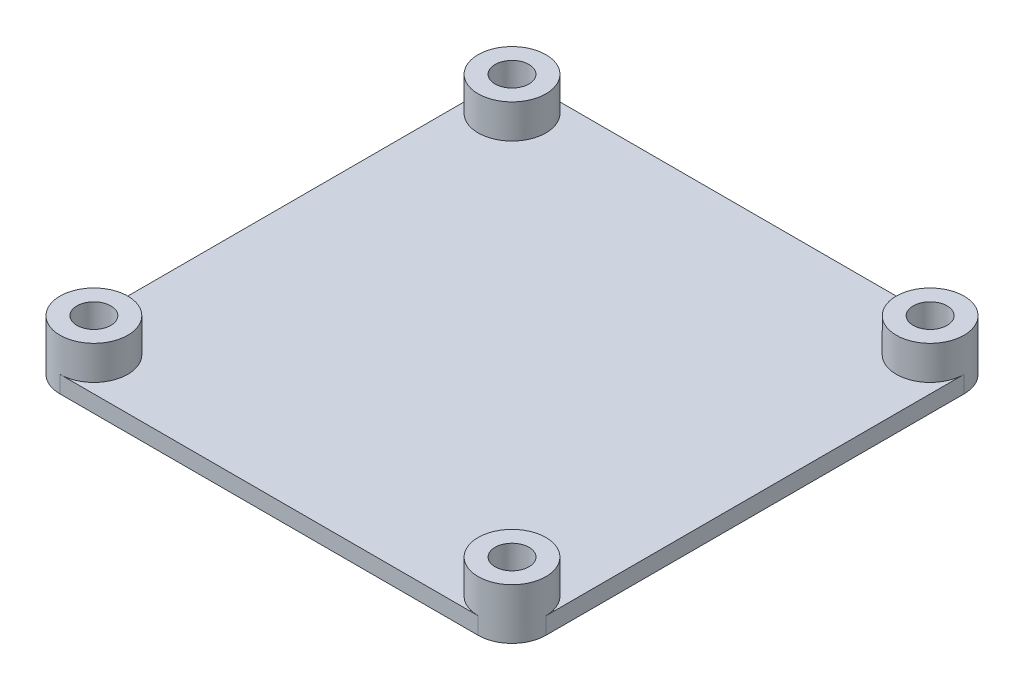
ISO-10303-21;
HEADER;
FILE_DESCRIPTION(('STEP AP214'),'2;1');
FILE_NAME('part.step','',(''),(''),'','','');
FILE_SCHEMA(('AUTOMOTIVE_DESIGN { 1 0 10303 214 1 1 1 1 }'));
ENDSEC;
DATA;
#1=APPLICATION_CONTEXT('core data for automotive mechanical design processes');
#2=APPLICATION_PROTOCOL_DEFINITION('international standard','automotive_design',2000,#1);
#3=PRODUCT_CONTEXT('',#1,'mechanical');
#4=PRODUCT('Part','Part','',(#3));
#5=PRODUCT_RELATED_PRODUCT_CATEGORY('part','',(#4));
#6=PRODUCT_DEFINITION_FORMATION('','',#4);
#7=PRODUCT_DEFINITION_CONTEXT('part definition',#1,'design');
#8=PRODUCT_DEFINITION('design','',#6,#7);
#9=PRODUCT_DEFINITION_SHAPE('','',#8);
#10=(LENGTH_UNIT() NAMED_UNIT(*) SI_UNIT(.MILLI.,.METRE.));
#11=(NAMED_UNIT(*) PLANE_ANGLE_UNIT() SI_UNIT($,.RADIAN.));
#12=(NAMED_UNIT(*) SI_UNIT($,.STERADIAN.) SOLID_ANGLE_UNIT());
#13=UNCERTAINTY_MEASURE_WITH_UNIT(LENGTH_MEASURE(1.E-05),#10,'distance_accuracy_value','');
#14=(GEOMETRIC_REPRESENTATION_CONTEXT(3) GLOBAL_UNCERTAINTY_ASSIGNED_CONTEXT((#13)) GLOBAL_UNIT_ASSIGNED_CONTEXT((#10,
#11,#12)) REPRESENTATION_CONTEXT('',''));
#15=CARTESIAN_POINT('',(0.,0.,0.));
#16=DIRECTION('',(0.,0.,1.));
#17=DIRECTION('',(1.,0.,0.));
#18=AXIS2_PLACEMENT_3D('',#15,#16,#17);
#19=CARTESIAN_POINT('',(-18.5,1.5,-18.5));
#20=DIRECTION('',(0.,1.,0.));
#21=DIRECTION('',(0.,0.,1.));
#22=AXIS2_PLACEMENT_3D('',#19,#20,#21);
#23=PLANE('',#22);
#24=DIRECTION('',(0.,0.,1.));
#25=VECTOR('',#24,1.);
#26=CARTESIAN_POINT('',(-21.5,1.5,-18.5));
#27=LINE('',#26,#25);
#28=CARTESIAN_POINT('',(-21.5,1.5,-18.5));
#29=VERTEX_POINT('',#28);
#30=CARTESIAN_POINT('',(-21.5,1.5,18.5));
#31=VERTEX_POINT('',#30);
#32=EDGE_CURVE('E116',#29,#31,#27,.T.);
#33=ORIENTED_EDGE('',*,*,#32,.T.);
#34=CARTESIAN_POINT('',(-18.5,1.5,18.5));
#35=DIRECTION('',(0.,1.,0.));
#36=DIRECTION('',(0.,0.,1.));
#37=AXIS2_PLACEMENT_3D('',#34,#35,#36);
#38=CIRCLE('',#37,3.);
#39=CARTESIAN_POINT('',(-18.5,1.5,21.5));
#40=VERTEX_POINT('',#39);
#41=EDGE_CURVE('E123',#40,#31,#38,.T.);
#42=ORIENTED_EDGE('',*,*,#41,.F.);
#43=DIRECTION('',(1.,0.,0.));
#44=VECTOR('',#43,1.);
#45=CARTESIAN_POINT('',(-18.5,1.5,21.5));
#46=LINE('',#45,#44);
#47=CARTESIAN_POINT('',(18.5,1.5,21.5));
#48=VERTEX_POINT('',#47);
#49=EDGE_CURVE('E106',#40,#48,#46,.T.);
#50=ORIENTED_EDGE('',*,*,#49,.T.);
#51=CARTESIAN_POINT('',(18.5,1.5,18.5));
#52=DIRECTION('',(0.,1.,0.));
#53=DIRECTION('',(0.,0.,1.));
#54=AXIS2_PLACEMENT_3D('',#51,#52,#53);
#55=CIRCLE('',#54,3.);
#56=CARTESIAN_POINT('',(21.5,1.5,18.5));
#57=VERTEX_POINT('',#56);
#58=EDGE_CURVE('E11',#48,#57,#55,.F.);
#59=ORIENTED_EDGE('',*,*,#58,.T.);
#60=DIRECTION('',(0.,0.,-1.));
#61=VECTOR('',#60,1.);
#62=CARTESIAN_POINT('',(21.5,1.5,-18.5));
#63=LINE('',#62,#61);
#64=CARTESIAN_POINT('',(21.5,1.5,-18.5));
#65=VERTEX_POINT('',#64);
#66=EDGE_CURVE('E115',#57,#65,#63,.T.);
#67=ORIENTED_EDGE('',*,*,#66,.T.);
#68=CARTESIAN_POINT('',(18.5,1.5,-18.5));
#69=DIRECTION('',(0.,1.,0.));
#70=DIRECTION('',(0.,0.,1.));
#71=AXIS2_PLACEMENT_3D('',#68,#69,#70);
#72=CIRCLE('',#71,3.);
#73=CARTESIAN_POINT('',(18.5,1.5,-21.5));
#74=VERTEX_POINT('',#73);
#75=EDGE_CURVE('E42',#65,#74,#72,.F.);
#76=ORIENTED_EDGE('',*,*,#75,.T.);
#77=DIRECTION('',(-1.,0.,0.));
#78=VECTOR('',#77,1.);
#79=CARTESIAN_POINT('',(-18.5,1.5,-21.5));
#80=LINE('',#79,#78);
#81=CARTESIAN_POINT('',(-18.5,1.5,-21.5));
#82=VERTEX_POINT('',#81);
#83=EDGE_CURVE('E152',#74,#82,#80,.T.);
#84=ORIENTED_EDGE('',*,*,#83,.T.);
#85=CARTESIAN_POINT('',(-18.5,1.5,-18.5));
#86=DIRECTION('',(0.,1.,0.));
#87=DIRECTION('',(0.,0.,1.));
#88=AXIS2_PLACEMENT_3D('',#85,#86,#87);
#89=CIRCLE('',#88,3.);
#90=EDGE_CURVE('E92',#29,#82,#89,.T.);
#91=ORIENTED_EDGE('',*,*,#90,.F.);
#92=EDGE_LOOP('',(#33,#42,#50,#59,#67,#76,#84,#91));
#93=FACE_BOUND('',#92,.T.);
#94=ADVANCED_FACE('F33',(#93),#23,.T.);
#95=CARTESIAN_POINT('',(-18.5,1.5,-18.5));
#96=DIRECTION('',(0.,-1.,0.));
#97=DIRECTION('',(0.,0.,-1.));
#98=AXIS2_PLACEMENT_3D('',#95,#96,#97);
#99=CYLINDRICAL_SURFACE('',#98,3.);
#100=CARTESIAN_POINT('',(-18.5,0.,-18.5));
#101=DIRECTION('',(0.,1.,0.));
#102=DIRECTION('',(0.,0.,1.));
#103=AXIS2_PLACEMENT_3D('',#100,#101,#102);
#104=CIRCLE('',#103,3.);
#105=CARTESIAN_POINT('',(-18.5,0.,-21.5));
#106=VERTEX_POINT('',#105);
#107=CARTESIAN_POINT('',(-21.5,0.,-18.5));
#108=VERTEX_POINT('',#107);
#109=EDGE_CURVE('E147',#106,#108,#104,.T.);
#110=ORIENTED_EDGE('',*,*,#109,.T.);
#111=DIRECTION('',(0.,-1.,0.));
#112=VECTOR('',#111,1.);
#113=CARTESIAN_POINT('',(-21.5,1.5,-18.5));
#114=LINE('',#113,#112);
#115=EDGE_CURVE('E149',#29,#108,#114,.T.);
#116=ORIENTED_EDGE('',*,*,#115,.F.);
#117=ORIENTED_EDGE('',*,*,#90,.T.);
#118=DIRECTION('',(0.,-1.,0.));
#119=VECTOR('',#118,1.);
#120=CARTESIAN_POINT('',(-18.5,1.5,-21.5));
#121=LINE('',#120,#119);
#122=EDGE_CURVE('E154',#82,#106,#121,.T.);
#123=ORIENTED_EDGE('',*,*,#122,.T.);
#124=EDGE_LOOP('',(#110,#116,#117,#123));
#125=FACE_BOUND('',#124,.T.);
#126=CARTESIAN_POINT('',(-18.5,4.5,-18.5));
#127=DIRECTION('',(0.,1.,0.));
#128=DIRECTION('',(0.,0.,1.));
#129=AXIS2_PLACEMENT_3D('',#126,#127,#128);
#130=CIRCLE('',#129,3.);
#131=CARTESIAN_POINT('',(-18.5,4.5,-15.5));
#132=VERTEX_POINT('',#131);
#133=EDGE_CURVE('E144',#132,#132,#130,.T.);
#134=ORIENTED_EDGE('',*,*,#133,.F.);
#135=EDGE_LOOP('',(#134));
#136=FACE_BOUND('',#135,.T.);
#137=ADVANCED_FACE('F35',(#125,#136),#99,.T.);
#138=CARTESIAN_POINT('',(-21.5,1.5,-18.5));
#139=DIRECTION('',(1.,0.,0.));
#140=DIRECTION('',(0.,0.,-1.));
#141=AXIS2_PLACEMENT_3D('',#138,#139,#140);
#142=PLANE('',#141);
#143=DIRECTION('',(0.,0.,1.));
#144=VECTOR('',#143,1.);
#145=CARTESIAN_POINT('',(-21.5,0.,-18.5));
#146=LINE('',#145,#144);
#147=CARTESIAN_POINT('',(-21.5,0.,18.5));
#148=VERTEX_POINT('',#147);
#149=EDGE_CURVE('E157',#108,#148,#146,.T.);
#150=ORIENTED_EDGE('',*,*,#149,.T.);
#151=DIRECTION('',(0.,-1.,0.));
#152=VECTOR('',#151,1.);
#153=CARTESIAN_POINT('',(-21.5,1.5,18.5));
#154=LINE('',#153,#152);
#155=EDGE_CURVE('E126',#31,#148,#154,.T.);
#156=ORIENTED_EDGE('',*,*,#155,.F.);
#157=ORIENTED_EDGE('',*,*,#32,.F.);
#158=ORIENTED_EDGE('',*,*,#115,.T.);
#159=EDGE_LOOP('',(#150,#156,#157,#158));
#160=FACE_BOUND('',#159,.T.);
#161=ADVANCED_FACE('F181',(#160),#142,.F.);
#162=CARTESIAN_POINT('',(-18.5,1.5,18.5));
#163=DIRECTION('',(0.,-1.,0.));
#164=DIRECTION('',(0.,0.,-1.));
#165=AXIS2_PLACEMENT_3D('',#162,#163,#164);
#166=CYLINDRICAL_SURFACE('',#165,3.);
#167=CARTESIAN_POINT('',(-18.5,0.,18.5));
#168=DIRECTION('',(0.,1.,0.));
#169=DIRECTION('',(0.,0.,1.));
#170=AXIS2_PLACEMENT_3D('',#167,#168,#169);
#171=CIRCLE('',#170,3.);
#172=CARTESIAN_POINT('',(-18.5,0.,21.5));
#173=VERTEX_POINT('',#172);
#174=EDGE_CURVE('E125',#148,#173,#171,.T.);
#175=ORIENTED_EDGE('',*,*,#174,.T.);
#176=DIRECTION('',(0.,-1.,0.));
#177=VECTOR('',#176,1.);
#178=CARTESIAN_POINT('',(-18.5,1.5,21.5));
#179=LINE('',#178,#177);
#180=EDGE_CURVE('E109',#40,#173,#179,.T.);
#181=ORIENTED_EDGE('',*,*,#180,.F.);
#182=ORIENTED_EDGE('',*,*,#41,.T.);
#183=ORIENTED_EDGE('',*,*,#155,.T.);
#184=EDGE_LOOP('',(#175,#181,#182,#183));
#185=FACE_BOUND('',#184,.T.);
#186=CARTESIAN_POINT('',(-18.5,4.5,18.5));
#187=DIRECTION('',(0.,1.,0.));
#188=DIRECTION('',(0.,0.,1.));
#189=AXIS2_PLACEMENT_3D('',#186,#187,#188);
#190=CIRCLE('',#189,3.);
#191=CARTESIAN_POINT('',(-18.5,4.5,21.5));
#192=VERTEX_POINT('',#191);
#193=EDGE_CURVE('E129',#192,#192,#190,.T.);
#194=ORIENTED_EDGE('',*,*,#193,.F.);
#195=EDGE_LOOP('',(#194));
#196=FACE_BOUND('',#195,.T.);
#197=ADVANCED_FACE('F120',(#185,#196),#166,.T.);
#198=CARTESIAN_POINT('',(-18.5,1.5,21.5));
#199=DIRECTION('',(0.,0.,-1.));
#200=DIRECTION('',(-1.,0.,0.));
#201=AXIS2_PLACEMENT_3D('',#198,#199,#200);
#202=PLANE('',#201);
#203=DIRECTION('',(1.,0.,0.));
#204=VECTOR('',#203,1.);
#205=CARTESIAN_POINT('',(-18.5,0.,21.5));
#206=LINE('',#205,#204);
#207=CARTESIAN_POINT('',(18.5,0.,21.5));
#208=VERTEX_POINT('',#207);
#209=EDGE_CURVE('E160',#173,#208,#206,.T.);
#210=ORIENTED_EDGE('',*,*,#209,.T.);
#211=DIRECTION('',(0.,-1.,0.));
#212=VECTOR('',#211,1.);
#213=CARTESIAN_POINT('',(18.5,1.5,21.5));
#214=LINE('',#213,#212);
#215=EDGE_CURVE('E112',#48,#208,#214,.T.);
#216=ORIENTED_EDGE('',*,*,#215,.F.);
#217=ORIENTED_EDGE('',*,*,#49,.F.);
#218=ORIENTED_EDGE('',*,*,#180,.T.);
#219=EDGE_LOOP('',(#210,#216,#217,#218));
#220=FACE_BOUND('',#219,.T.);
#221=ADVANCED_FACE('F108',(#220),#202,.F.);
#222=CARTESIAN_POINT('',(18.5,1.5,18.5));
#223=DIRECTION('',(0.,-1.,0.));
#224=DIRECTION('',(0.,0.,-1.));
#225=AXIS2_PLACEMENT_3D('',#222,#223,#224);
#226=CYLINDRICAL_SURFACE('',#225,3.);
#227=CARTESIAN_POINT('',(18.5,0.,18.5));
#228=DIRECTION('',(0.,1.,0.));
#229=DIRECTION('',(0.,0.,1.));
#230=AXIS2_PLACEMENT_3D('',#227,#228,#229);
#231=CIRCLE('',#230,3.);
#232=CARTESIAN_POINT('',(21.5,0.,18.5));
#233=VERTEX_POINT('',#232);
#234=EDGE_CURVE('E162',#208,#233,#231,.T.);
#235=ORIENTED_EDGE('',*,*,#234,.T.);
#236=DIRECTION('',(0.,-1.,0.));
#237=VECTOR('',#236,1.);
#238=CARTESIAN_POINT('',(21.5,1.5,18.5));
#239=LINE('',#238,#237);
#240=EDGE_CURVE('E173',#57,#233,#239,.T.);
#241=ORIENTED_EDGE('',*,*,#240,.F.);
#242=ORIENTED_EDGE('',*,*,#58,.F.);
#243=ORIENTED_EDGE('',*,*,#215,.T.);
#244=EDGE_LOOP('',(#235,#241,#242,#243));
#245=FACE_BOUND('',#244,.T.);
#246=CARTESIAN_POINT('',(18.5,4.5,18.5));
#247=DIRECTION('',(0.,1.,0.));
#248=DIRECTION('',(0.,0.,1.));
#249=AXIS2_PLACEMENT_3D('',#246,#247,#248);
#250=CIRCLE('',#249,3.);
#251=CARTESIAN_POINT('',(18.5,4.5,21.5));
#252=VERTEX_POINT('',#251);
#253=EDGE_CURVE('E133',#252,#252,#250,.T.);
#254=ORIENTED_EDGE('',*,*,#253,.F.);
#255=EDGE_LOOP('',(#254));
#256=FACE_BOUND('',#255,.T.);
#257=ADVANCED_FACE('F190',(#245,#256),#226,.T.);
#258=CARTESIAN_POINT('',(21.5,1.5,-18.5));
#259=DIRECTION('',(-1.,0.,0.));
#260=DIRECTION('',(0.,0.,1.));
#261=AXIS2_PLACEMENT_3D('',#258,#259,#260);
#262=PLANE('',#261);
#263=DIRECTION('',(0.,0.,-1.));
#264=VECTOR('',#263,1.);
#265=CARTESIAN_POINT('',(21.5,0.,-18.5));
#266=LINE('',#265,#264);
#267=CARTESIAN_POINT('',(21.5,0.,-18.5));
#268=VERTEX_POINT('',#267);
#269=EDGE_CURVE('E164',#233,#268,#266,.T.);
#270=ORIENTED_EDGE('',*,*,#269,.T.);
#271=DIRECTION('',(0.,-1.,0.));
#272=VECTOR('',#271,1.);
#273=CARTESIAN_POINT('',(21.5,1.5,-18.5));
#274=LINE('',#273,#272);
#275=EDGE_CURVE('E171',#65,#268,#274,.T.);
#276=ORIENTED_EDGE('',*,*,#275,.F.);
#277=ORIENTED_EDGE('',*,*,#66,.F.);
#278=ORIENTED_EDGE('',*,*,#240,.T.);
#279=EDGE_LOOP('',(#270,#276,#277,#278));
#280=FACE_BOUND('',#279,.T.);
#281=ADVANCED_FACE('F195',(#280),#262,.F.);
#282=CARTESIAN_POINT('',(18.5,1.5,-18.5));
#283=DIRECTION('',(0.,-1.,0.));
#284=DIRECTION('',(0.,0.,-1.));
#285=AXIS2_PLACEMENT_3D('',#282,#283,#284);
#286=CYLINDRICAL_SURFACE('',#285,3.);
#287=CARTESIAN_POINT('',(18.5,0.,-18.5));
#288=DIRECTION('',(0.,1.,0.));
#289=DIRECTION('',(0.,0.,1.));
#290=AXIS2_PLACEMENT_3D('',#287,#288,#289);
#291=CIRCLE('',#290,3.);
#292=CARTESIAN_POINT('',(18.5,0.,-21.5));
#293=VERTEX_POINT('',#292);
#294=EDGE_CURVE('E79',#268,#293,#291,.T.);
#295=ORIENTED_EDGE('',*,*,#294,.T.);
#296=DIRECTION('',(0.,-1.,0.));
#297=VECTOR('',#296,1.);
#298=CARTESIAN_POINT('',(18.5,1.5,-21.5));
#299=LINE('',#298,#297);
#300=EDGE_CURVE('E169',#74,#293,#299,.T.);
#301=ORIENTED_EDGE('',*,*,#300,.F.);
#302=ORIENTED_EDGE('',*,*,#75,.F.);
#303=ORIENTED_EDGE('',*,*,#275,.T.);
#304=EDGE_LOOP('',(#295,#301,#302,#303));
#305=FACE_BOUND('',#304,.T.);
#306=CARTESIAN_POINT('',(18.5,4.5,-18.5));
#307=DIRECTION('',(0.,1.,0.));
#308=DIRECTION('',(0.,0.,1.));
#309=AXIS2_PLACEMENT_3D('',#306,#307,#308);
#310=CIRCLE('',#309,3.);
#311=CARTESIAN_POINT('',(18.5,4.5,-15.5));
#312=VERTEX_POINT('',#311);
#313=EDGE_CURVE('E141',#312,#312,#310,.T.);
#314=ORIENTED_EDGE('',*,*,#313,.F.);
#315=EDGE_LOOP('',(#314));
#316=FACE_BOUND('',#315,.T.);
#317=ADVANCED_FACE('F196',(#305,#316),#286,.T.);
#318=CARTESIAN_POINT('',(-18.5,1.5,-21.5));
#319=DIRECTION('',(0.,0.,1.));
#320=DIRECTION('',(1.,0.,0.));
#321=AXIS2_PLACEMENT_3D('',#318,#319,#320);
#322=PLANE('',#321);
#323=DIRECTION('',(-1.,0.,0.));
#324=VECTOR('',#323,1.);
#325=CARTESIAN_POINT('',(-18.5,0.,-21.5));
#326=LINE('',#325,#324);
#327=EDGE_CURVE('E86',#293,#106,#326,.T.);
#328=ORIENTED_EDGE('',*,*,#327,.T.);
#329=ORIENTED_EDGE('',*,*,#122,.F.);
#330=ORIENTED_EDGE('',*,*,#83,.F.);
#331=ORIENTED_EDGE('',*,*,#300,.T.);
#332=EDGE_LOOP('',(#328,#329,#330,#331));
#333=FACE_BOUND('',#332,.T.);
#334=ADVANCED_FACE('F199',(#333),#322,.F.);
#335=CARTESIAN_POINT('',(-18.5,0.,-18.5));
#336=DIRECTION('',(0.,1.,0.));
#337=DIRECTION('',(0.,0.,1.));
#338=AXIS2_PLACEMENT_3D('',#335,#336,#337);
#339=PLANE('',#338);
#340=CARTESIAN_POINT('',(-18.5,0.,18.5));
#341=DIRECTION('',(0.,1.,0.));
#342=DIRECTION('',(0.,0.,1.));
#343=AXIS2_PLACEMENT_3D('',#340,#341,#342);
#344=CIRCLE('',#343,1.5);
#345=CARTESIAN_POINT('',(-18.5,0.,20.));
#346=VERTEX_POINT('',#345);
#347=EDGE_CURVE('E254',#346,#346,#344,.T.);
#348=ORIENTED_EDGE('',*,*,#347,.T.);
#349=EDGE_LOOP('',(#348));
#350=FACE_BOUND('',#349,.T.);
#351=CARTESIAN_POINT('',(-18.5,0.,-18.5));
#352=DIRECTION('',(0.,1.,0.));
#353=DIRECTION('',(0.,0.,1.));
#354=AXIS2_PLACEMENT_3D('',#351,#352,#353);
#355=CIRCLE('',#354,1.5);
#356=CARTESIAN_POINT('',(-18.5,0.,-17.));
#357=VERTEX_POINT('',#356);
#358=EDGE_CURVE('E258',#357,#357,#355,.T.);
#359=ORIENTED_EDGE('',*,*,#358,.T.);
#360=EDGE_LOOP('',(#359));
#361=FACE_BOUND('',#360,.T.);
#362=CARTESIAN_POINT('',(18.5,0.,18.5));
#363=DIRECTION('',(0.,1.,0.));
#364=DIRECTION('',(0.,0.,1.));
#365=AXIS2_PLACEMENT_3D('',#362,#363,#364);
#366=CIRCLE('',#365,1.5);
#367=CARTESIAN_POINT('',(18.5,0.,20.));
#368=VERTEX_POINT('',#367);
#369=EDGE_CURVE('E267',#368,#368,#366,.T.);
#370=ORIENTED_EDGE('',*,*,#369,.T.);
#371=EDGE_LOOP('',(#370));
#372=FACE_BOUND('',#371,.T.);
#373=CARTESIAN_POINT('',(18.5,0.,-18.5));
#374=DIRECTION('',(0.,1.,0.));
#375=DIRECTION('',(0.,0.,1.));
#376=AXIS2_PLACEMENT_3D('',#373,#374,#375);
#377=CIRCLE('',#376,1.5);
#378=CARTESIAN_POINT('',(18.5,0.,-17.));
#379=VERTEX_POINT('',#378);
#380=EDGE_CURVE('E130',#379,#379,#377,.T.);
#381=ORIENTED_EDGE('',*,*,#380,.T.);
#382=EDGE_LOOP('',(#381));
#383=FACE_BOUND('',#382,.T.);
#384=ORIENTED_EDGE('',*,*,#109,.F.);
#385=ORIENTED_EDGE('',*,*,#327,.F.);
#386=ORIENTED_EDGE('',*,*,#294,.F.);
#387=ORIENTED_EDGE('',*,*,#269,.F.);
#388=ORIENTED_EDGE('',*,*,#234,.F.);
#389=ORIENTED_EDGE('',*,*,#209,.F.);
#390=ORIENTED_EDGE('',*,*,#174,.F.);
#391=ORIENTED_EDGE('',*,*,#149,.F.);
#392=EDGE_LOOP('',(#384,#385,#386,#387,#388,#389,#390,#391));
#393=FACE_BOUND('',#392,.T.);
#394=ADVANCED_FACE('F186',(#350,#361,#372,#383,#393),#339,.F.);
#395=CARTESIAN_POINT('',(-18.5,4.5,-18.5));
#396=DIRECTION('',(0.,1.,0.));
#397=DIRECTION('',(0.,0.,1.));
#398=AXIS2_PLACEMENT_3D('',#395,#396,#397);
#399=PLANE('',#398);
#400=CARTESIAN_POINT('',(-18.5,4.5,-18.5));
#401=DIRECTION('',(0.,1.,0.));
#402=DIRECTION('',(0.,0.,1.));
#403=AXIS2_PLACEMENT_3D('',#400,#401,#402);
#404=CIRCLE('',#403,1.5);
#405=CARTESIAN_POINT('',(-18.5,4.5,-17.));
#406=VERTEX_POINT('',#405);
#407=EDGE_CURVE('E255',#406,#406,#404,.T.);
#408=ORIENTED_EDGE('',*,*,#407,.F.);
#409=EDGE_LOOP('',(#408));
#410=FACE_BOUND('',#409,.T.);
#411=ORIENTED_EDGE('',*,*,#133,.T.);
#412=EDGE_LOOP('',(#411));
#413=FACE_BOUND('',#412,.T.);
#414=ADVANCED_FACE('F206',(#410,#413),#399,.T.);
#415=CARTESIAN_POINT('',(18.5,4.5,-18.5));
#416=DIRECTION('',(0.,1.,0.));
#417=DIRECTION('',(0.,0.,1.));
#418=AXIS2_PLACEMENT_3D('',#415,#416,#417);
#419=PLANE('',#418);
#420=CARTESIAN_POINT('',(18.5,4.5,-18.5));
#421=DIRECTION('',(0.,1.,0.));
#422=DIRECTION('',(0.,0.,1.));
#423=AXIS2_PLACEMENT_3D('',#420,#421,#422);
#424=CIRCLE('',#423,1.5);
#425=CARTESIAN_POINT('',(18.5,4.5,-17.));
#426=VERTEX_POINT('',#425);
#427=EDGE_CURVE('E136',#426,#426,#424,.T.);
#428=ORIENTED_EDGE('',*,*,#427,.F.);
#429=EDGE_LOOP('',(#428));
#430=FACE_BOUND('',#429,.T.);
#431=ORIENTED_EDGE('',*,*,#313,.T.);
#432=EDGE_LOOP('',(#431));
#433=FACE_BOUND('',#432,.T.);
#434=ADVANCED_FACE('F218',(#430,#433),#419,.T.);
#435=CARTESIAN_POINT('',(18.5,4.5,18.5));
#436=DIRECTION('',(0.,1.,0.));
#437=DIRECTION('',(0.,0.,1.));
#438=AXIS2_PLACEMENT_3D('',#435,#436,#437);
#439=PLANE('',#438);
#440=CARTESIAN_POINT('',(18.5,4.5,18.5));
#441=DIRECTION('',(0.,1.,0.));
#442=DIRECTION('',(0.,0.,1.));
#443=AXIS2_PLACEMENT_3D('',#440,#441,#442);
#444=CIRCLE('',#443,1.5);
#445=CARTESIAN_POINT('',(18.5,4.5,20.));
#446=VERTEX_POINT('',#445);
#447=EDGE_CURVE('E264',#446,#446,#444,.T.);
#448=ORIENTED_EDGE('',*,*,#447,.F.);
#449=EDGE_LOOP('',(#448));
#450=FACE_BOUND('',#449,.T.);
#451=ORIENTED_EDGE('',*,*,#253,.T.);
#452=EDGE_LOOP('',(#451));
#453=FACE_BOUND('',#452,.T.);
#454=ADVANCED_FACE('F222',(#450,#453),#439,.T.);
#455=CARTESIAN_POINT('',(-18.5,4.5,18.5));
#456=DIRECTION('',(0.,1.,0.));
#457=DIRECTION('',(0.,0.,1.));
#458=AXIS2_PLACEMENT_3D('',#455,#456,#457);
#459=PLANE('',#458);
#460=CARTESIAN_POINT('',(-18.5,4.5,18.5));
#461=DIRECTION('',(0.,1.,0.));
#462=DIRECTION('',(0.,0.,1.));
#463=AXIS2_PLACEMENT_3D('',#460,#461,#462);
#464=CIRCLE('',#463,1.5);
#465=CARTESIAN_POINT('',(-18.5,4.5,20.));
#466=VERTEX_POINT('',#465);
#467=EDGE_CURVE('E251',#466,#466,#464,.T.);
#468=ORIENTED_EDGE('',*,*,#467,.F.);
#469=EDGE_LOOP('',(#468));
#470=FACE_BOUND('',#469,.T.);
#471=ORIENTED_EDGE('',*,*,#193,.T.);
#472=EDGE_LOOP('',(#471));
#473=FACE_BOUND('',#472,.T.);
#474=ADVANCED_FACE('F226',(#470,#473),#459,.T.);
#475=CARTESIAN_POINT('',(18.5,-0.5,-18.5));
#476=DIRECTION('',(0.,1.,0.));
#477=DIRECTION('',(0.,0.,1.));
#478=AXIS2_PLACEMENT_3D('',#475,#476,#477);
#479=CYLINDRICAL_SURFACE('',#478,1.5);
#480=ORIENTED_EDGE('',*,*,#427,.T.);
#481=EDGE_LOOP('',(#480));
#482=FACE_BOUND('',#481,.T.);
#483=ORIENTED_EDGE('',*,*,#380,.F.);
#484=EDGE_LOOP('',(#483));
#485=FACE_BOUND('',#484,.T.);
#486=ADVANCED_FACE('F230',(#482,#485),#479,.F.);
#487=CARTESIAN_POINT('',(18.5,-0.5,18.5));
#488=DIRECTION('',(0.,1.,0.));
#489=DIRECTION('',(0.,0.,1.));
#490=AXIS2_PLACEMENT_3D('',#487,#488,#489);
#491=CYLINDRICAL_SURFACE('',#490,1.5);
#492=ORIENTED_EDGE('',*,*,#447,.T.);
#493=EDGE_LOOP('',(#492));
#494=FACE_BOUND('',#493,.T.);
#495=ORIENTED_EDGE('',*,*,#369,.F.);
#496=EDGE_LOOP('',(#495));
#497=FACE_BOUND('',#496,.T.);
#498=ADVANCED_FACE('F234',(#494,#497),#491,.F.);
#499=CARTESIAN_POINT('',(-18.5,-0.5,-18.5));
#500=DIRECTION('',(0.,1.,0.));
#501=DIRECTION('',(0.,0.,1.));
#502=AXIS2_PLACEMENT_3D('',#499,#500,#501);
#503=CYLINDRICAL_SURFACE('',#502,1.5);
#504=ORIENTED_EDGE('',*,*,#407,.T.);
#505=EDGE_LOOP('',(#504));
#506=FACE_BOUND('',#505,.T.);
#507=ORIENTED_EDGE('',*,*,#358,.F.);
#508=EDGE_LOOP('',(#507));
#509=FACE_BOUND('',#508,.T.);
#510=ADVANCED_FACE('F238',(#506,#509),#503,.F.);
#511=CARTESIAN_POINT('',(-18.5,-0.5,18.5));
#512=DIRECTION('',(0.,1.,0.));
#513=DIRECTION('',(0.,0.,1.));
#514=AXIS2_PLACEMENT_3D('',#511,#512,#513);
#515=CYLINDRICAL_SURFACE('',#514,1.5);
#516=ORIENTED_EDGE('',*,*,#467,.T.);
#517=EDGE_LOOP('',(#516));
#518=FACE_BOUND('',#517,.T.);
#519=ORIENTED_EDGE('',*,*,#347,.F.);
#520=EDGE_LOOP('',(#519));
#521=FACE_BOUND('',#520,.T.);
#522=ADVANCED_FACE('F242',(#518,#521),#515,.F.);
#523=CLOSED_SHELL('',(#94,#137,#161,#197,#221,#257,#281,#317,#334,#394,#414,#434,#454,#474,#486,
#498,#510,#522));
#524=MANIFOLD_SOLID_BREP('B2',#523);
#525=ADVANCED_BREP_SHAPE_REPRESENTATION('',(#18,#524),#14);
#526=SHAPE_DEFINITION_REPRESENTATION(#9,#525);
ENDSEC;
END-ISO-10303-21;
